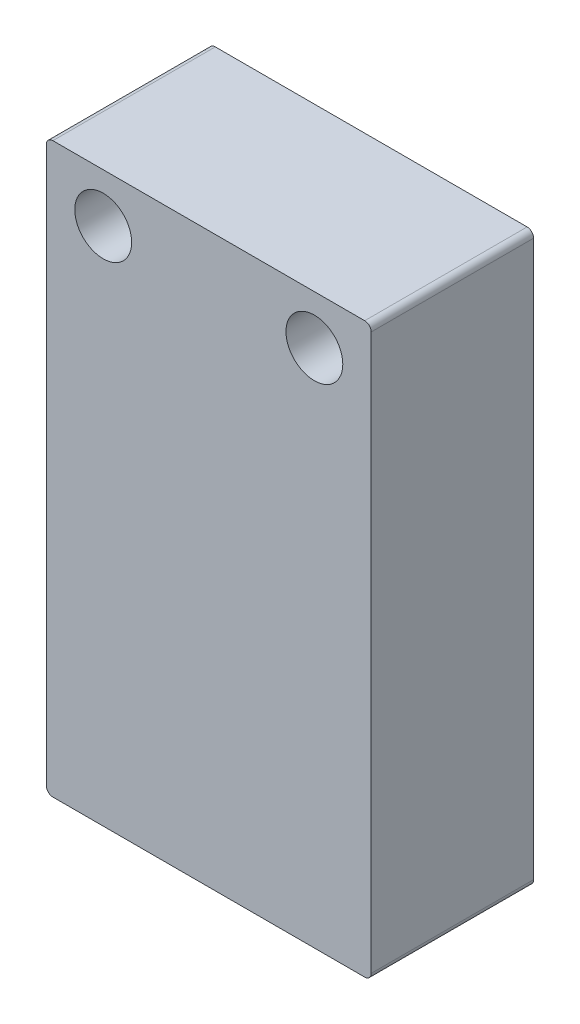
ISO-10303-21;
HEADER;
FILE_DESCRIPTION(('STEP AP214'),'2;1');
FILE_NAME('part.step','',(''),(''),'','','');
FILE_SCHEMA(('AUTOMOTIVE_DESIGN { 1 0 10303 214 1 1 1 1 }'));
ENDSEC;
DATA;
#1=APPLICATION_CONTEXT('core data for automotive mechanical design processes');
#2=APPLICATION_PROTOCOL_DEFINITION('international standard','automotive_design',2000,#1);
#3=PRODUCT_CONTEXT('',#1,'mechanical');
#4=PRODUCT('Part','Part','',(#3));
#5=PRODUCT_RELATED_PRODUCT_CATEGORY('part','',(#4));
#6=PRODUCT_DEFINITION_FORMATION('','',#4);
#7=PRODUCT_DEFINITION_CONTEXT('part definition',#1,'design');
#8=PRODUCT_DEFINITION('design','',#6,#7);
#9=PRODUCT_DEFINITION_SHAPE('','',#8);
#10=(LENGTH_UNIT() NAMED_UNIT(*) SI_UNIT(.MILLI.,.METRE.));
#11=(NAMED_UNIT(*) PLANE_ANGLE_UNIT() SI_UNIT($,.RADIAN.));
#12=(NAMED_UNIT(*) SI_UNIT($,.STERADIAN.) SOLID_ANGLE_UNIT());
#13=UNCERTAINTY_MEASURE_WITH_UNIT(LENGTH_MEASURE(1.E-05),#10,'distance_accuracy_value','');
#14=(GEOMETRIC_REPRESENTATION_CONTEXT(3) GLOBAL_UNCERTAINTY_ASSIGNED_CONTEXT((#13)) GLOBAL_UNIT_ASSIGNED_CONTEXT((#10,
#11,#12)) REPRESENTATION_CONTEXT('',''));
#15=CARTESIAN_POINT('',(0.,0.,0.));
#16=DIRECTION('',(0.,0.,1.));
#17=DIRECTION('',(1.,0.,0.));
#18=AXIS2_PLACEMENT_3D('',#15,#16,#17);
#19=CARTESIAN_POINT('',(0.8,69.2,-20.));
#20=DIRECTION('',(0.,0.,1.));
#21=DIRECTION('',(1.,0.,0.));
#22=AXIS2_PLACEMENT_3D('',#19,#20,#21);
#23=CYLINDRICAL_SURFACE('',#22,0.799999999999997);
#24=CARTESIAN_POINT('',(0.8,69.2,0.));
#25=DIRECTION('',(0.,0.,1.));
#26=DIRECTION('',(-1.,0.,0.));
#27=AXIS2_PLACEMENT_3D('',#24,#25,#26);
#28=CIRCLE('',#27,0.799999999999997);
#29=CARTESIAN_POINT('',(0.800000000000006,70.,0.));
#30=VERTEX_POINT('',#29);
#31=CARTESIAN_POINT('',(0.,69.2,0.));
#32=VERTEX_POINT('',#31);
#33=EDGE_CURVE('E92',#30,#32,#28,.T.);
#34=ORIENTED_EDGE('',*,*,#33,.F.);
#35=DIRECTION('',(0.,0.,1.));
#36=VECTOR('',#35,1.);
#37=CARTESIAN_POINT('',(0.800000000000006,70.,-20.));
#38=LINE('',#37,#36);
#39=CARTESIAN_POINT('',(0.800000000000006,70.,-20.));
#40=VERTEX_POINT('',#39);
#41=EDGE_CURVE('E11',#40,#30,#38,.T.);
#42=ORIENTED_EDGE('',*,*,#41,.F.);
#43=CARTESIAN_POINT('',(0.8,69.2,-20.));
#44=DIRECTION('',(0.,0.,1.));
#45=DIRECTION('',(-1.,0.,0.));
#46=AXIS2_PLACEMENT_3D('',#43,#44,#45);
#47=CIRCLE('',#46,0.799999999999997);
#48=CARTESIAN_POINT('',(0.,69.2,-20.));
#49=VERTEX_POINT('',#48);
#50=EDGE_CURVE('E94',#40,#49,#47,.T.);
#51=ORIENTED_EDGE('',*,*,#50,.T.);
#52=DIRECTION('',(0.,0.,1.));
#53=VECTOR('',#52,1.);
#54=CARTESIAN_POINT('',(0.,69.2,-20.));
#55=LINE('',#54,#53);
#56=EDGE_CURVE('E31',#49,#32,#55,.T.);
#57=ORIENTED_EDGE('',*,*,#56,.T.);
#58=EDGE_LOOP('',(#34,#42,#51,#57));
#59=FACE_BOUND('',#58,.T.);
#60=ADVANCED_FACE('F28',(#59),#23,.T.);
#61=CARTESIAN_POINT('',(0.800000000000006,70.,-20.));
#62=DIRECTION('',(0.,1.,0.));
#63=DIRECTION('',(0.,0.,1.));
#64=AXIS2_PLACEMENT_3D('',#61,#62,#63);
#65=PLANE('',#64);
#66=DIRECTION('',(-1.,0.,0.));
#67=VECTOR('',#66,1.);
#68=CARTESIAN_POINT('',(0.800000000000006,70.,0.));
#69=LINE('',#68,#67);
#70=CARTESIAN_POINT('',(39.2,70.,0.));
#71=VERTEX_POINT('',#70);
#72=EDGE_CURVE('E110',#71,#30,#69,.T.);
#73=ORIENTED_EDGE('',*,*,#72,.F.);
#74=DIRECTION('',(0.,0.,1.));
#75=VECTOR('',#74,1.);
#76=CARTESIAN_POINT('',(39.2,70.,-20.));
#77=LINE('',#76,#75);
#78=CARTESIAN_POINT('',(39.2,70.,-20.));
#79=VERTEX_POINT('',#78);
#80=EDGE_CURVE('E36',#79,#71,#77,.T.);
#81=ORIENTED_EDGE('',*,*,#80,.F.);
#82=DIRECTION('',(-1.,0.,0.));
#83=VECTOR('',#82,1.);
#84=CARTESIAN_POINT('',(0.800000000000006,70.,-20.));
#85=LINE('',#84,#83);
#86=EDGE_CURVE('E99',#79,#40,#85,.T.);
#87=ORIENTED_EDGE('',*,*,#86,.T.);
#88=ORIENTED_EDGE('',*,*,#41,.T.);
#89=EDGE_LOOP('',(#73,#81,#87,#88));
#90=FACE_BOUND('',#89,.T.);
#91=ADVANCED_FACE('F176',(#90),#65,.T.);
#92=CARTESIAN_POINT('',(39.2,69.2,-20.));
#93=DIRECTION('',(0.,0.,1.));
#94=DIRECTION('',(1.,0.,0.));
#95=AXIS2_PLACEMENT_3D('',#92,#93,#94);
#96=CYLINDRICAL_SURFACE('',#95,0.799999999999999);
#97=CARTESIAN_POINT('',(39.2,69.2,0.));
#98=DIRECTION('',(0.,0.,1.));
#99=DIRECTION('',(-1.,0.,0.));
#100=AXIS2_PLACEMENT_3D('',#97,#98,#99);
#101=CIRCLE('',#100,0.799999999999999);
#102=CARTESIAN_POINT('',(40.,69.2,0.));
#103=VERTEX_POINT('',#102);
#104=EDGE_CURVE('E128',#103,#71,#101,.T.);
#105=ORIENTED_EDGE('',*,*,#104,.F.);
#106=DIRECTION('',(0.,0.,1.));
#107=VECTOR('',#106,1.);
#108=CARTESIAN_POINT('',(40.,69.2,-20.));
#109=LINE('',#108,#107);
#110=CARTESIAN_POINT('',(40.,69.2,-20.));
#111=VERTEX_POINT('',#110);
#112=EDGE_CURVE('E150',#111,#103,#109,.T.);
#113=ORIENTED_EDGE('',*,*,#112,.F.);
#114=CARTESIAN_POINT('',(39.2,69.2,-20.));
#115=DIRECTION('',(0.,0.,1.));
#116=DIRECTION('',(-1.,0.,0.));
#117=AXIS2_PLACEMENT_3D('',#114,#115,#116);
#118=CIRCLE('',#117,0.799999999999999);
#119=EDGE_CURVE('E146',#111,#79,#118,.T.);
#120=ORIENTED_EDGE('',*,*,#119,.T.);
#121=ORIENTED_EDGE('',*,*,#80,.T.);
#122=EDGE_LOOP('',(#105,#113,#120,#121));
#123=FACE_BOUND('',#122,.T.);
#124=ADVANCED_FACE('F175',(#123),#96,.T.);
#125=CARTESIAN_POINT('',(40.,0.800000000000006,-20.));
#126=DIRECTION('',(1.,0.,0.));
#127=DIRECTION('',(0.,0.,-1.));
#128=AXIS2_PLACEMENT_3D('',#125,#126,#127);
#129=PLANE('',#128);
#130=DIRECTION('',(0.,1.,0.));
#131=VECTOR('',#130,1.);
#132=CARTESIAN_POINT('',(40.,0.800000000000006,0.));
#133=LINE('',#132,#131);
#134=CARTESIAN_POINT('',(40.,0.800000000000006,0.));
#135=VERTEX_POINT('',#134);
#136=EDGE_CURVE('E125',#135,#103,#133,.T.);
#137=ORIENTED_EDGE('',*,*,#136,.F.);
#138=DIRECTION('',(0.,0.,1.));
#139=VECTOR('',#138,1.);
#140=CARTESIAN_POINT('',(40.,0.800000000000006,-20.));
#141=LINE('',#140,#139);
#142=CARTESIAN_POINT('',(40.,0.800000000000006,-20.));
#143=VERTEX_POINT('',#142);
#144=EDGE_CURVE('E152',#143,#135,#141,.T.);
#145=ORIENTED_EDGE('',*,*,#144,.F.);
#146=DIRECTION('',(0.,1.,0.));
#147=VECTOR('',#146,1.);
#148=CARTESIAN_POINT('',(40.,0.800000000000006,-20.));
#149=LINE('',#148,#147);
#150=EDGE_CURVE('E143',#143,#111,#149,.T.);
#151=ORIENTED_EDGE('',*,*,#150,.T.);
#152=ORIENTED_EDGE('',*,*,#112,.T.);
#153=EDGE_LOOP('',(#137,#145,#151,#152));
#154=FACE_BOUND('',#153,.T.);
#155=ADVANCED_FACE('F171',(#154),#129,.T.);
#156=CARTESIAN_POINT('',(39.2,0.8,-20.));
#157=DIRECTION('',(0.,0.,1.));
#158=DIRECTION('',(1.,0.,0.));
#159=AXIS2_PLACEMENT_3D('',#156,#157,#158);
#160=CYLINDRICAL_SURFACE('',#159,0.800000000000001);
#161=CARTESIAN_POINT('',(39.2,0.8,0.));
#162=DIRECTION('',(0.,0.,1.));
#163=DIRECTION('',(1.,0.,0.));
#164=AXIS2_PLACEMENT_3D('',#161,#162,#163);
#165=CIRCLE('',#164,0.800000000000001);
#166=CARTESIAN_POINT('',(39.2,0.,0.));
#167=VERTEX_POINT('',#166);
#168=EDGE_CURVE('E122',#167,#135,#165,.T.);
#169=ORIENTED_EDGE('',*,*,#168,.F.);
#170=DIRECTION('',(0.,0.,1.));
#171=VECTOR('',#170,1.);
#172=CARTESIAN_POINT('',(39.2,0.,-20.));
#173=LINE('',#172,#171);
#174=CARTESIAN_POINT('',(39.2,0.,-20.));
#175=VERTEX_POINT('',#174);
#176=EDGE_CURVE('E154',#175,#167,#173,.T.);
#177=ORIENTED_EDGE('',*,*,#176,.F.);
#178=CARTESIAN_POINT('',(39.2,0.8,-20.));
#179=DIRECTION('',(0.,0.,1.));
#180=DIRECTION('',(1.,0.,0.));
#181=AXIS2_PLACEMENT_3D('',#178,#179,#180);
#182=CIRCLE('',#181,0.800000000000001);
#183=EDGE_CURVE('E140',#175,#143,#182,.T.);
#184=ORIENTED_EDGE('',*,*,#183,.T.);
#185=ORIENTED_EDGE('',*,*,#144,.T.);
#186=EDGE_LOOP('',(#169,#177,#184,#185));
#187=FACE_BOUND('',#186,.T.);
#188=ADVANCED_FACE('F167',(#187),#160,.T.);
#189=CARTESIAN_POINT('',(0.800000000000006,0.,-20.));
#190=DIRECTION('',(0.,-1.,0.));
#191=DIRECTION('',(0.,0.,-1.));
#192=AXIS2_PLACEMENT_3D('',#189,#190,#191);
#193=PLANE('',#192);
#194=DIRECTION('',(1.,0.,0.));
#195=VECTOR('',#194,1.);
#196=CARTESIAN_POINT('',(0.800000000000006,0.,0.));
#197=LINE('',#196,#195);
#198=CARTESIAN_POINT('',(0.800000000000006,0.,0.));
#199=VERTEX_POINT('',#198);
#200=EDGE_CURVE('E119',#199,#167,#197,.T.);
#201=ORIENTED_EDGE('',*,*,#200,.F.);
#202=DIRECTION('',(0.,0.,1.));
#203=VECTOR('',#202,1.);
#204=CARTESIAN_POINT('',(0.800000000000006,0.,-20.));
#205=LINE('',#204,#203);
#206=CARTESIAN_POINT('',(0.800000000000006,0.,-20.));
#207=VERTEX_POINT('',#206);
#208=EDGE_CURVE('E156',#207,#199,#205,.T.);
#209=ORIENTED_EDGE('',*,*,#208,.F.);
#210=DIRECTION('',(1.,0.,0.));
#211=VECTOR('',#210,1.);
#212=CARTESIAN_POINT('',(0.800000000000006,0.,-20.));
#213=LINE('',#212,#211);
#214=EDGE_CURVE('E137',#207,#175,#213,.T.);
#215=ORIENTED_EDGE('',*,*,#214,.T.);
#216=ORIENTED_EDGE('',*,*,#176,.T.);
#217=EDGE_LOOP('',(#201,#209,#215,#216));
#218=FACE_BOUND('',#217,.T.);
#219=ADVANCED_FACE('F163',(#218),#193,.T.);
#220=CARTESIAN_POINT('',(0.8,0.8,-20.));
#221=DIRECTION('',(0.,0.,1.));
#222=DIRECTION('',(1.,0.,0.));
#223=AXIS2_PLACEMENT_3D('',#220,#221,#222);
#224=CYLINDRICAL_SURFACE('',#223,0.8);
#225=CARTESIAN_POINT('',(0.8,0.8,0.));
#226=DIRECTION('',(0.,0.,1.));
#227=DIRECTION('',(-1.,0.,0.));
#228=AXIS2_PLACEMENT_3D('',#225,#226,#227);
#229=CIRCLE('',#228,0.8);
#230=CARTESIAN_POINT('',(0.,0.800000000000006,0.));
#231=VERTEX_POINT('',#230);
#232=EDGE_CURVE('E106',#231,#199,#229,.T.);
#233=ORIENTED_EDGE('',*,*,#232,.F.);
#234=DIRECTION('',(0.,0.,1.));
#235=VECTOR('',#234,1.);
#236=CARTESIAN_POINT('',(0.,0.800000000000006,-20.));
#237=LINE('',#236,#235);
#238=CARTESIAN_POINT('',(0.,0.800000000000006,-20.));
#239=VERTEX_POINT('',#238);
#240=EDGE_CURVE('E98',#239,#231,#237,.T.);
#241=ORIENTED_EDGE('',*,*,#240,.F.);
#242=CARTESIAN_POINT('',(0.8,0.8,-20.));
#243=DIRECTION('',(0.,0.,1.));
#244=DIRECTION('',(-1.,0.,0.));
#245=AXIS2_PLACEMENT_3D('',#242,#243,#244);
#246=CIRCLE('',#245,0.8);
#247=EDGE_CURVE('E134',#239,#207,#246,.T.);
#248=ORIENTED_EDGE('',*,*,#247,.T.);
#249=ORIENTED_EDGE('',*,*,#208,.T.);
#250=EDGE_LOOP('',(#233,#241,#248,#249));
#251=FACE_BOUND('',#250,.T.);
#252=ADVANCED_FACE('F159',(#251),#224,.T.);
#253=CARTESIAN_POINT('',(0.,0.800000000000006,-20.));
#254=DIRECTION('',(-1.,0.,0.));
#255=DIRECTION('',(0.,0.,1.));
#256=AXIS2_PLACEMENT_3D('',#253,#254,#255);
#257=PLANE('',#256);
#258=DIRECTION('',(0.,-1.,0.));
#259=VECTOR('',#258,1.);
#260=CARTESIAN_POINT('',(0.,0.800000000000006,0.));
#261=LINE('',#260,#259);
#262=EDGE_CURVE('E101',#32,#231,#261,.T.);
#263=ORIENTED_EDGE('',*,*,#262,.F.);
#264=ORIENTED_EDGE('',*,*,#56,.F.);
#265=DIRECTION('',(0.,-1.,0.));
#266=VECTOR('',#265,1.);
#267=CARTESIAN_POINT('',(0.,0.800000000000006,-20.));
#268=LINE('',#267,#266);
#269=EDGE_CURVE('E132',#49,#239,#268,.T.);
#270=ORIENTED_EDGE('',*,*,#269,.T.);
#271=ORIENTED_EDGE('',*,*,#240,.T.);
#272=EDGE_LOOP('',(#263,#264,#270,#271));
#273=FACE_BOUND('',#272,.T.);
#274=ADVANCED_FACE('F102',(#273),#257,.T.);
#275=CARTESIAN_POINT('',(0.8,69.2,-20.));
#276=DIRECTION('',(0.,0.,-1.));
#277=DIRECTION('',(-1.,0.,0.));
#278=AXIS2_PLACEMENT_3D('',#275,#276,#277);
#279=PLANE('',#278);
#280=CARTESIAN_POINT('',(33.,64.,-20.));
#281=DIRECTION('',(0.,0.,1.));
#282=DIRECTION('',(1.,0.,0.));
#283=AXIS2_PLACEMENT_3D('',#280,#281,#282);
#284=CIRCLE('',#283,3.5);
#285=CARTESIAN_POINT('',(36.5,64.,-20.));
#286=VERTEX_POINT('',#285);
#287=EDGE_CURVE('E242',#286,#286,#284,.T.);
#288=ORIENTED_EDGE('',*,*,#287,.T.);
#289=EDGE_LOOP('',(#288));
#290=FACE_BOUND('',#289,.T.);
#291=CARTESIAN_POINT('',(7.,64.,-20.));
#292=DIRECTION('',(0.,0.,1.));
#293=DIRECTION('',(1.,0.,0.));
#294=AXIS2_PLACEMENT_3D('',#291,#292,#293);
#295=CIRCLE('',#294,3.5);
#296=CARTESIAN_POINT('',(10.5,64.,-20.));
#297=VERTEX_POINT('',#296);
#298=EDGE_CURVE('E111',#297,#297,#295,.T.);
#299=ORIENTED_EDGE('',*,*,#298,.T.);
#300=EDGE_LOOP('',(#299));
#301=FACE_BOUND('',#300,.T.);
#302=ORIENTED_EDGE('',*,*,#50,.F.);
#303=ORIENTED_EDGE('',*,*,#86,.F.);
#304=ORIENTED_EDGE('',*,*,#119,.F.);
#305=ORIENTED_EDGE('',*,*,#150,.F.);
#306=ORIENTED_EDGE('',*,*,#183,.F.);
#307=ORIENTED_EDGE('',*,*,#214,.F.);
#308=ORIENTED_EDGE('',*,*,#247,.F.);
#309=ORIENTED_EDGE('',*,*,#269,.F.);
#310=EDGE_LOOP('',(#302,#303,#304,#305,#306,#307,#308,#309));
#311=FACE_BOUND('',#310,.T.);
#312=ADVANCED_FACE('F179',(#290,#301,#311),#279,.T.);
#313=CARTESIAN_POINT('',(0.8,69.2,0.));
#314=DIRECTION('',(0.,0.,-1.));
#315=DIRECTION('',(-1.,0.,0.));
#316=AXIS2_PLACEMENT_3D('',#313,#314,#315);
#317=PLANE('',#316);
#318=CARTESIAN_POINT('',(33.,64.,0.));
#319=DIRECTION('',(0.,0.,1.));
#320=DIRECTION('',(1.,0.,0.));
#321=AXIS2_PLACEMENT_3D('',#318,#319,#320);
#322=CIRCLE('',#321,3.5);
#323=CARTESIAN_POINT('',(36.5,64.,0.));
#324=VERTEX_POINT('',#323);
#325=EDGE_CURVE('E245',#324,#324,#322,.T.);
#326=ORIENTED_EDGE('',*,*,#325,.F.);
#327=EDGE_LOOP('',(#326));
#328=FACE_BOUND('',#327,.T.);
#329=CARTESIAN_POINT('',(7.,64.,0.));
#330=DIRECTION('',(0.,0.,1.));
#331=DIRECTION('',(1.,0.,0.));
#332=AXIS2_PLACEMENT_3D('',#329,#330,#331);
#333=CIRCLE('',#332,3.5);
#334=CARTESIAN_POINT('',(10.5,64.,0.));
#335=VERTEX_POINT('',#334);
#336=EDGE_CURVE('E114',#335,#335,#333,.T.);
#337=ORIENTED_EDGE('',*,*,#336,.F.);
#338=EDGE_LOOP('',(#337));
#339=FACE_BOUND('',#338,.T.);
#340=ORIENTED_EDGE('',*,*,#33,.T.);
#341=ORIENTED_EDGE('',*,*,#262,.T.);
#342=ORIENTED_EDGE('',*,*,#232,.T.);
#343=ORIENTED_EDGE('',*,*,#200,.T.);
#344=ORIENTED_EDGE('',*,*,#168,.T.);
#345=ORIENTED_EDGE('',*,*,#136,.T.);
#346=ORIENTED_EDGE('',*,*,#104,.T.);
#347=ORIENTED_EDGE('',*,*,#72,.T.);
#348=EDGE_LOOP('',(#340,#341,#342,#343,#344,#345,#346,#347));
#349=FACE_BOUND('',#348,.T.);
#350=ADVANCED_FACE('F108',(#328,#339,#349),#317,.F.);
#351=CARTESIAN_POINT('',(7.,64.,-20.));
#352=DIRECTION('',(0.,0.,1.));
#353=DIRECTION('',(1.,0.,0.));
#354=AXIS2_PLACEMENT_3D('',#351,#352,#353);
#355=CYLINDRICAL_SURFACE('',#354,3.5);
#356=ORIENTED_EDGE('',*,*,#298,.F.);
#357=EDGE_LOOP('',(#356));
#358=FACE_BOUND('',#357,.T.);
#359=ORIENTED_EDGE('',*,*,#336,.T.);
#360=EDGE_LOOP('',(#359));
#361=FACE_BOUND('',#360,.T.);
#362=ADVANCED_FACE('F187',(#358,#361),#355,.F.);
#363=CARTESIAN_POINT('',(33.,64.,-20.));
#364=DIRECTION('',(0.,0.,1.));
#365=DIRECTION('',(1.,0.,0.));
#366=AXIS2_PLACEMENT_3D('',#363,#364,#365);
#367=CYLINDRICAL_SURFACE('',#366,3.5);
#368=ORIENTED_EDGE('',*,*,#287,.F.);
#369=EDGE_LOOP('',(#368));
#370=FACE_BOUND('',#369,.T.);
#371=ORIENTED_EDGE('',*,*,#325,.T.);
#372=EDGE_LOOP('',(#371));
#373=FACE_BOUND('',#372,.T.);
#374=ADVANCED_FACE('F230',(#370,#373),#367,.F.);
#375=CLOSED_SHELL('',(#60,#91,#124,#155,#188,#219,#252,#274,#312,#350,#362,#374));
#376=MANIFOLD_SOLID_BREP('B2',#375);
#377=ADVANCED_BREP_SHAPE_REPRESENTATION('',(#18,#376),#14);
#378=SHAPE_DEFINITION_REPRESENTATION(#9,#377);
ENDSEC;
END-ISO-10303-21;
